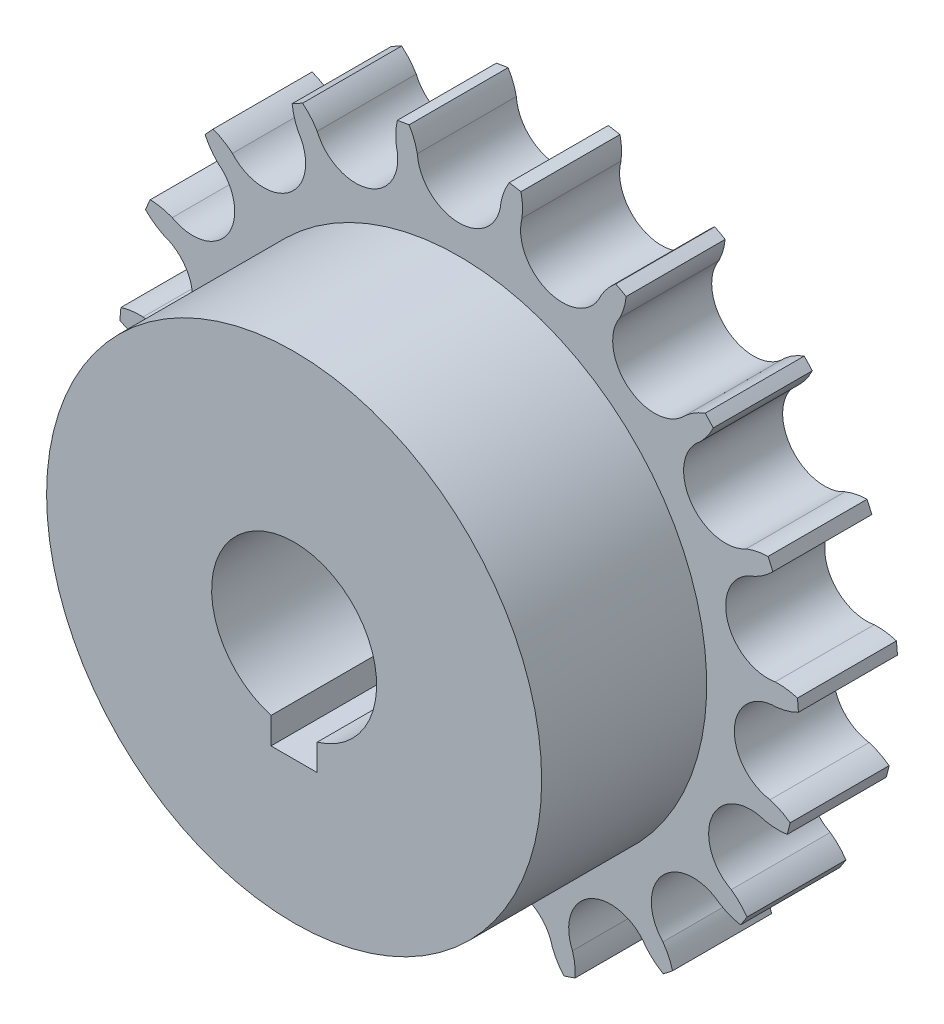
from build123d import *

# Parameters (mm, degrees)
BASE_EXTRUSION_DEPTH    = 15
ESQUISSE3_R             = 37.5
BOSS_EXTRU_1_DEPTH      = 25
ESQUISSE6_R             = 12.5
ENL_V_MAT_EXTRU_3_DEPTH = 84.025596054
ESQUISSE7_R             = 25
ENL_V_MAT_EXTRU_4_DEPTH = 5
ESQUISSE8_W             = 7
ESQUISSE8_H             = 40
ENL_V_MAT_EXTRU_5_DEPTH = 16


with BuildPart() as part:
    # Esquisse1 → Base-Extrusion (new body)
    with BuildSketch(Plane.XY):
        with BuildLine():
            ThreePointArc((9.521345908, 47.248449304), (13.588672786, 39.582451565), (21.506918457, 43.133797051))
            ThreePointArc((21.506918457, 43.133797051), (22.495552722, 44.52306987), (23.715043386, 45.714841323))
            ThreePointArc((23.715043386, 45.714841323), (24.511290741, 45.292898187), (25.300033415, 44.857087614))
            ThreePointArc((25.300033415, 44.857087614), (24.969320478, 43.184333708), (24.346999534, 41.596822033))
            ThreePointArc((24.346999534, 41.596822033), (25.704802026, 33.025530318), (34.3471353, 33.813403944))
            ThreePointArc((34.3471353, 33.813403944), (35.73329878, 34.806393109), (37.273681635, 35.537623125))
            ThreePointArc((37.273681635, 35.537623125), (37.8897814, 34.880000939), (38.494280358, 34.211699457))
            ThreePointArc((38.494280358, 34.211699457), (37.638344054, 32.736962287), (36.534277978, 31.437533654))
            ThreePointArc((36.534277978, 31.437533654), (35.035417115, 22.889780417), (43.465307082, 20.82880385))
            ThreePointArc((43.465307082, 20.82880385), (45.098787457, 21.317903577), (46.793138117, 21.509352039))
            ThreePointArc((46.793138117, 21.509352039), (47.162326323, 20.68731437), (47.517074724, 19.858942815))
            ThreePointArc((47.517074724, 19.858942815), (46.228669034, 18.742033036), (44.762500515, 17.871500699))
            ThreePointArc((44.762500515, 17.871500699), (40.56940113, 10.273567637), (47.873338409, 5.587079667))
            ThreePointArc((47.873338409, 5.587079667), (49.577122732, 5.519288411), (51.241832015, 5.150208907))
            ThreePointArc((51.241832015, 5.150208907), (51.32410139, 4.252836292), (51.39065674, 3.354161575))
            ThreePointArc((51.39065674, 3.354161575), (49.809400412, 2.716113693), (48.14001156, 2.368813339))
            ThreePointArc((48.14001156, 2.368813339), (41.707061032, -3.455945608), (47.093550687, -10.260091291))
            ThreePointArc((47.093550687, -10.260091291), (48.683007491, -10.877427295), (50.137678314, -11.767039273))
            ThreePointArc((50.137678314, -11.767039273), (49.924113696, -12.642502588), (49.69526369, -13.514095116))
            ThreePointArc((49.69526369, -13.514095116), (47.992510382, -13.604138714), (46.300805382, -13.390571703))
            ThreePointArc((46.300805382, -13.390571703), (38.325113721, -16.810953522), (41.210446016, -24.995422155))
            ThreePointArc((41.210446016, -24.995422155), (42.513332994, -26.095404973), (43.600329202, -27.409146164))
            ThreePointArc((43.600329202, -27.409146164), (43.114073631, -28.167830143), (42.614617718, -28.917889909))
            ThreePointArc((42.614617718, -28.917889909), (40.974887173, -28.450171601), (39.444188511, -27.698880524))
            ThreePointArc((39.444188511, -27.698880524), (30.790045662, -28.344233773), (30.861550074, -37.022111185))
            ThreePointArc((30.861550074, -37.022111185), (31.736679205, -38.48554061), (32.338207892, -40.081046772))
            ThreePointArc((32.338207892, -40.081046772), (31.631954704, -40.640736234), (30.916016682, -41.187982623))
            ThreePointArc((30.916016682, -41.187982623), (29.516999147, -40.213186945), (28.313181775, -39.005585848))
            ThreePointArc((28.313181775, -39.005585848), (19.918398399, -36.805976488), (17.168326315, -45.036880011))
            ThreePointArc((17.168326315, -45.036880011), (17.520863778, -46.705170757), (17.571739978, -48.40954404))
            ThreePointArc((17.571739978, -48.40954404), (16.722022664, -48.709587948), (15.867185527, -48.994718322))
            ThreePointArc((15.867185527, -48.994718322), (14.86048626, -47.618479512), (14.114002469, -46.085430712))
            ThreePointArc((14.114002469, -46.085430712), (6.888283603, -41.279220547), (1.614648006, -48.171204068))
            ThreePointArc((1.614648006, -48.171204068), (1.406390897, -49.863570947), (0.901101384, -51.49211606))
            ThreePointArc((0.901101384, -51.49211606), (0, -51.5), (-0.901101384, -51.49211606))
            ThreePointArc((-0.901101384, -51.49211606), (-1.406390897, -49.863570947), (-1.614648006, -48.171204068))
            ThreePointArc((-1.614648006, -48.171204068), (-6.888283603, -41.279220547), (-14.114002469, -46.085430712))
            ThreePointArc((-14.114002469, -46.085430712), (-14.86048626, -47.618479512), (-15.867185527, -48.994718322))
            ThreePointArc((-15.867185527, -48.994718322), (-16.722022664, -48.709587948), (-17.571739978, -48.40954404))
            ThreePointArc((-17.571739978, -48.40954404), (-17.520863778, -46.705170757), (-17.168326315, -45.036880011))
            ThreePointArc((-17.168326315, -45.036880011), (-19.918398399, -36.805976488), (-28.313181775, -39.005585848))
            ThreePointArc((-28.313181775, -39.005585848), (-29.516999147, -40.213186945), (-30.916016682, -41.187982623))
            ThreePointArc((-30.916016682, -41.187982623), (-31.631954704, -40.640736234), (-32.338207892, -40.081046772))
            ThreePointArc((-32.338207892, -40.081046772), (-31.736679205, -38.48554061), (-30.861550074, -37.022111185))
            ThreePointArc((-30.861550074, -37.022111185), (-30.790045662, -28.344233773), (-39.444188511, -27.698880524))
            ThreePointArc((-39.444188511, -27.698880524), (-40.974887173, -28.450171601), (-42.614617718, -28.917889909))
            ThreePointArc((-42.614617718, -28.917889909), (-43.114073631, -28.167830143), (-43.600329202, -27.409146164))
            ThreePointArc((-43.600329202, -27.409146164), (-42.513332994, -26.095404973), (-41.210446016, -24.995422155))
            ThreePointArc((-41.210446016, -24.995422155), (-38.325113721, -16.810953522), (-46.300805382, -13.390571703))
            ThreePointArc((-46.300805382, -13.390571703), (-47.992510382, -13.604138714), (-49.69526369, -13.514095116))
            ThreePointArc((-49.69526369, -13.514095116), (-49.924113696, -12.642502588), (-50.137678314, -11.767039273))
            ThreePointArc((-50.137678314, -11.767039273), (-48.683007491, -10.877427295), (-47.093550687, -10.260091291))
            ThreePointArc((-47.093550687, -10.260091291), (-41.707061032, -3.455945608), (-48.14001156, 2.368813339))
            ThreePointArc((-48.14001156, 2.368813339), (-49.809400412, 2.716113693), (-51.39065674, 3.354161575))
            ThreePointArc((-51.39065674, 3.354161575), (-51.32410139, 4.252836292), (-51.241832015, 5.150208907))
            ThreePointArc((-51.241832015, 5.150208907), (-49.577122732, 5.519288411), (-47.873338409, 5.587079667))
            ThreePointArc((-47.873338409, 5.587079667), (-40.56940113, 10.273567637), (-44.762500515, 17.871500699))
            ThreePointArc((-44.762500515, 17.871500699), (-46.228669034, 18.742033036), (-47.517074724, 19.858942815))
            ThreePointArc((-47.517074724, 19.858942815), (-47.162326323, 20.68731437), (-46.793138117, 21.509352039))
            ThreePointArc((-46.793138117, 21.509352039), (-45.098787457, 21.317903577), (-43.465307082, 20.82880385))
            ThreePointArc((-43.465307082, 20.82880385), (-35.035417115, 22.889780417), (-36.534277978, 31.437533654))
            ThreePointArc((-36.534277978, 31.437533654), (-37.638344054, 32.736962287), (-38.494280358, 34.211699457))
            ThreePointArc((-38.494280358, 34.211699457), (-37.8897814, 34.880000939), (-37.273681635, 35.537623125))
            ThreePointArc((-37.273681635, 35.537623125), (-35.73329878, 34.806393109), (-34.3471353, 33.813403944))
            ThreePointArc((-34.3471353, 33.813403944), (-25.704802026, 33.025530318), (-24.346999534, 41.596822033))
            ThreePointArc((-24.346999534, 41.596822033), (-24.969320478, 43.184333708), (-25.300033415, 44.857087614))
            ThreePointArc((-25.300033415, 44.857087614), (-24.511290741, 45.292898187), (-23.715043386, 45.714841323))
            ThreePointArc((-23.715043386, 45.714841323), (-22.495552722, 44.52306987), (-21.506918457, 43.133797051))
            ThreePointArc((-21.506918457, 43.133797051), (-13.588672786, 39.582451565), (-9.521345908, 47.248449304))
            ThreePointArc((-9.521345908, 47.248449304), (-9.594483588, 48.952012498), (-9.364135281, 50.641514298))
            ThreePointArc((-9.364135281, 50.641514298), (-8.476621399, 50.797607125), (-7.58651221, 50.938147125))
            ThreePointArc((-7.58651221, 50.938147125), (-6.820064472, 49.414981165), (-6.336093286, 47.779973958))
            ThreePointArc((-6.336093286, 47.779973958), (0, 41.85), (6.336093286, 47.779973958))
            ThreePointArc((6.336093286, 47.779973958), (6.820064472, 49.414981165), (7.58651221, 50.938147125))
            ThreePointArc((7.58651221, 50.938147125), (8.476621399, 50.797607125), (9.364135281, 50.641514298))
            ThreePointArc((9.364135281, 50.641514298), (9.594483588, 48.952012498), (9.521345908, 47.248449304))
        make_face()
    extrude(amount=BASE_EXTRUSION_DEPTH)

    # Esquisse3 → Boss.-Extru.1 (add)
    with BuildSketch(Plane.XY.offset(15)):
        with Locations(Location((0, 0, 0), (0, 0, 180))):
            Circle(ESQUISSE3_R)
    extrude(amount=BOSS_EXTRU_1_DEPTH)

    # Esquisse6 → Enl_v. mat.-Extru.3 (cut, through all)
    with BuildSketch(Plane.XY.offset(40)):
        Circle(ESQUISSE6_R)
    extrude(amount=-ENL_V_MAT_EXTRU_3_DEPTH, mode=Mode.SUBTRACT)

    # Esquisse7 → Enl_v. mat.-Extru.4 (cut)
    with BuildSketch(Plane(origin=(0, 0, 0), x_dir=(-1, 0, 0), z_dir=(0, 0, -1))):
        Circle(ESQUISSE7_R)
    extrude(amount=-ENL_V_MAT_EXTRU_4_DEPTH, mode=Mode.SUBTRACT)

    # Esquisse8 → Enl_v. mat.-Extru.5 (cut)
    with BuildSketch(Plane(origin=(0, 0, 0), x_dir=(1, 0, 0), z_dir=(0, 1, 0))):
        with Locations((0, -20)):
            Rectangle(ESQUISSE8_W, ESQUISSE8_H)
    extrude(amount=-ENL_V_MAT_EXTRU_5_DEPTH, mode=Mode.SUBTRACT)


solid = part.part
